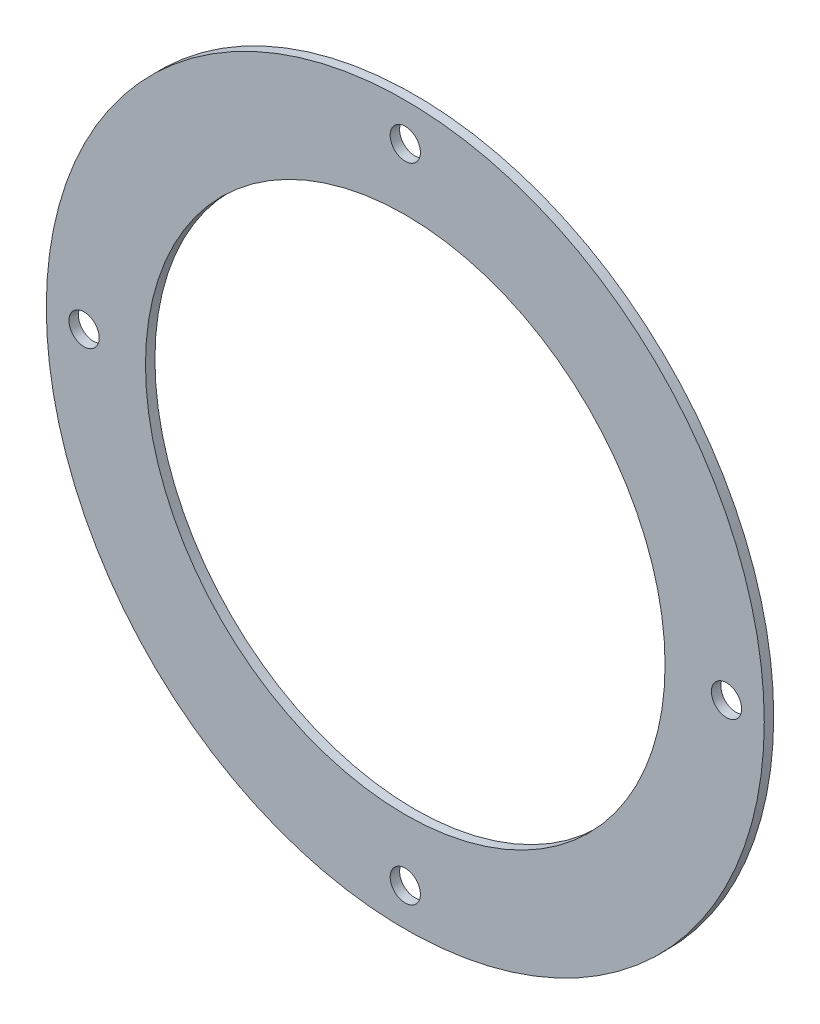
ISO-10303-21;
HEADER;
FILE_DESCRIPTION(('STEP AP214'),'2;1');
FILE_NAME('part.step','',(''),(''),'','','');
FILE_SCHEMA(('AUTOMOTIVE_DESIGN { 1 0 10303 214 1 1 1 1 }'));
ENDSEC;
DATA;
#1=APPLICATION_CONTEXT('core data for automotive mechanical design processes');
#2=APPLICATION_PROTOCOL_DEFINITION('international standard','automotive_design',2000,#1);
#3=PRODUCT_CONTEXT('',#1,'mechanical');
#4=PRODUCT('Part','Part','',(#3));
#5=PRODUCT_RELATED_PRODUCT_CATEGORY('part','',(#4));
#6=PRODUCT_DEFINITION_FORMATION('','',#4);
#7=PRODUCT_DEFINITION_CONTEXT('part definition',#1,'design');
#8=PRODUCT_DEFINITION('design','',#6,#7);
#9=PRODUCT_DEFINITION_SHAPE('','',#8);
#10=(LENGTH_UNIT() NAMED_UNIT(*) SI_UNIT(.MILLI.,.METRE.));
#11=(NAMED_UNIT(*) PLANE_ANGLE_UNIT() SI_UNIT($,.RADIAN.));
#12=(NAMED_UNIT(*) SI_UNIT($,.STERADIAN.) SOLID_ANGLE_UNIT());
#13=UNCERTAINTY_MEASURE_WITH_UNIT(LENGTH_MEASURE(1.E-05),#10,'distance_accuracy_value','');
#14=(GEOMETRIC_REPRESENTATION_CONTEXT(3) GLOBAL_UNCERTAINTY_ASSIGNED_CONTEXT((#13)) GLOBAL_UNIT_ASSIGNED_CONTEXT((#10,
#11,#12)) REPRESENTATION_CONTEXT('',''));
#15=CARTESIAN_POINT('',(0.,0.,0.));
#16=DIRECTION('',(0.,0.,1.));
#17=DIRECTION('',(1.,0.,0.));
#18=AXIS2_PLACEMENT_3D('',#15,#16,#17);
#19=CARTESIAN_POINT('',(0.,0.,0.));
#20=DIRECTION('',(0.,0.,1.));
#21=DIRECTION('',(1.,0.,0.));
#22=AXIS2_PLACEMENT_3D('',#19,#20,#21);
#23=PLANE('',#22);
#24=CARTESIAN_POINT('',(-34.,0.,0.));
#25=DIRECTION('',(0.,0.,1.));
#26=DIRECTION('',(1.,0.,0.));
#27=AXIS2_PLACEMENT_3D('',#24,#25,#26);
#28=CIRCLE('',#27,1.6);
#29=CARTESIAN_POINT('',(-32.4,0.,0.));
#30=VERTEX_POINT('',#29);
#31=EDGE_CURVE('E66',#30,#30,#28,.T.);
#32=ORIENTED_EDGE('',*,*,#31,.T.);
#33=EDGE_LOOP('',(#32));
#34=FACE_BOUND('',#33,.T.);
#35=CARTESIAN_POINT('',(0.,-34.,0.));
#36=DIRECTION('',(0.,0.,1.));
#37=DIRECTION('',(1.,0.,0.));
#38=AXIS2_PLACEMENT_3D('',#35,#36,#37);
#39=CIRCLE('',#38,1.6);
#40=CARTESIAN_POINT('',(1.6,-34.,0.));
#41=VERTEX_POINT('',#40);
#42=EDGE_CURVE('E61',#41,#41,#39,.T.);
#43=ORIENTED_EDGE('',*,*,#42,.T.);
#44=EDGE_LOOP('',(#43));
#45=FACE_BOUND('',#44,.T.);
#46=CARTESIAN_POINT('',(34.,0.,0.));
#47=DIRECTION('',(0.,0.,1.));
#48=DIRECTION('',(1.,0.,0.));
#49=AXIS2_PLACEMENT_3D('',#46,#47,#48);
#50=CIRCLE('',#49,1.6);
#51=CARTESIAN_POINT('',(35.6,0.,0.));
#52=VERTEX_POINT('',#51);
#53=EDGE_CURVE('E53',#52,#52,#50,.T.);
#54=ORIENTED_EDGE('',*,*,#53,.T.);
#55=EDGE_LOOP('',(#54));
#56=FACE_BOUND('',#55,.T.);
#57=CARTESIAN_POINT('',(0.,34.,0.));
#58=DIRECTION('',(0.,0.,1.));
#59=DIRECTION('',(1.,0.,0.));
#60=AXIS2_PLACEMENT_3D('',#57,#58,#59);
#61=CIRCLE('',#60,1.6);
#62=CARTESIAN_POINT('',(1.6,34.,0.));
#63=VERTEX_POINT('',#62);
#64=EDGE_CURVE('E45',#63,#63,#61,.T.);
#65=ORIENTED_EDGE('',*,*,#64,.T.);
#66=EDGE_LOOP('',(#65));
#67=FACE_BOUND('',#66,.T.);
#68=CARTESIAN_POINT('',(0.,0.,0.));
#69=DIRECTION('',(0.,0.,1.));
#70=DIRECTION('',(1.,0.,0.));
#71=AXIS2_PLACEMENT_3D('',#68,#69,#70);
#72=CIRCLE('',#71,27.5);
#73=CARTESIAN_POINT('',(27.5,0.,0.));
#74=VERTEX_POINT('',#73);
#75=EDGE_CURVE('E32',#74,#74,#72,.T.);
#76=ORIENTED_EDGE('',*,*,#75,.T.);
#77=EDGE_LOOP('',(#76));
#78=FACE_BOUND('',#77,.T.);
#79=CARTESIAN_POINT('',(0.,0.,0.));
#80=DIRECTION('',(0.,0.,1.));
#81=DIRECTION('',(1.,0.,0.));
#82=AXIS2_PLACEMENT_3D('',#79,#80,#81);
#83=CIRCLE('',#82,38.);
#84=CARTESIAN_POINT('',(38.,0.,0.));
#85=VERTEX_POINT('',#84);
#86=EDGE_CURVE('E10',#85,#85,#83,.T.);
#87=ORIENTED_EDGE('',*,*,#86,.F.);
#88=EDGE_LOOP('',(#87));
#89=FACE_BOUND('',#88,.T.);
#90=ADVANCED_FACE('F15',(#34,#45,#56,#67,#78,#89),#23,.F.);
#91=CARTESIAN_POINT('',(0.,0.,1.));
#92=DIRECTION('',(0.,0.,1.));
#93=DIRECTION('',(1.,0.,0.));
#94=AXIS2_PLACEMENT_3D('',#91,#92,#93);
#95=PLANE('',#94);
#96=CARTESIAN_POINT('',(-34.,0.,1.));
#97=DIRECTION('',(0.,0.,1.));
#98=DIRECTION('',(1.,0.,0.));
#99=AXIS2_PLACEMENT_3D('',#96,#97,#98);
#100=CIRCLE('',#99,1.6);
#101=CARTESIAN_POINT('',(-32.4,0.,1.));
#102=VERTEX_POINT('',#101);
#103=EDGE_CURVE('E70',#102,#102,#100,.T.);
#104=ORIENTED_EDGE('',*,*,#103,.F.);
#105=EDGE_LOOP('',(#104));
#106=FACE_BOUND('',#105,.T.);
#107=CARTESIAN_POINT('',(34.,0.,1.));
#108=DIRECTION('',(0.,0.,1.));
#109=DIRECTION('',(1.,0.,0.));
#110=AXIS2_PLACEMENT_3D('',#107,#108,#109);
#111=CIRCLE('',#110,1.6);
#112=CARTESIAN_POINT('',(35.6,0.,1.));
#113=VERTEX_POINT('',#112);
#114=EDGE_CURVE('E57',#113,#113,#111,.T.);
#115=ORIENTED_EDGE('',*,*,#114,.F.);
#116=EDGE_LOOP('',(#115));
#117=FACE_BOUND('',#116,.T.);
#118=CARTESIAN_POINT('',(0.,0.,1.));
#119=DIRECTION('',(0.,0.,1.));
#120=DIRECTION('',(1.,0.,0.));
#121=AXIS2_PLACEMENT_3D('',#118,#119,#120);
#122=CIRCLE('',#121,27.5);
#123=CARTESIAN_POINT('',(27.5,0.,1.));
#124=VERTEX_POINT('',#123);
#125=EDGE_CURVE('E39',#124,#124,#122,.T.);
#126=ORIENTED_EDGE('',*,*,#125,.F.);
#127=EDGE_LOOP('',(#126));
#128=FACE_BOUND('',#127,.T.);
#129=CARTESIAN_POINT('',(0.,34.,1.));
#130=DIRECTION('',(0.,0.,1.));
#131=DIRECTION('',(1.,0.,0.));
#132=AXIS2_PLACEMENT_3D('',#129,#130,#131);
#133=CIRCLE('',#132,1.6);
#134=CARTESIAN_POINT('',(1.6,34.,1.));
#135=VERTEX_POINT('',#134);
#136=EDGE_CURVE('E49',#135,#135,#133,.T.);
#137=ORIENTED_EDGE('',*,*,#136,.F.);
#138=EDGE_LOOP('',(#137));
#139=FACE_BOUND('',#138,.T.);
#140=CARTESIAN_POINT('',(0.,-34.,1.));
#141=DIRECTION('',(0.,0.,1.));
#142=DIRECTION('',(1.,0.,0.));
#143=AXIS2_PLACEMENT_3D('',#140,#141,#142);
#144=CIRCLE('',#143,1.6);
#145=CARTESIAN_POINT('',(1.6,-34.,1.));
#146=VERTEX_POINT('',#145);
#147=EDGE_CURVE('E65',#146,#146,#144,.T.);
#148=ORIENTED_EDGE('',*,*,#147,.F.);
#149=EDGE_LOOP('',(#148));
#150=FACE_BOUND('',#149,.T.);
#151=CARTESIAN_POINT('',(0.,0.,1.));
#152=DIRECTION('',(0.,0.,1.));
#153=DIRECTION('',(1.,0.,0.));
#154=AXIS2_PLACEMENT_3D('',#151,#152,#153);
#155=CIRCLE('',#154,38.);
#156=CARTESIAN_POINT('',(38.,0.,1.));
#157=VERTEX_POINT('',#156);
#158=EDGE_CURVE('E23',#157,#157,#155,.T.);
#159=ORIENTED_EDGE('',*,*,#158,.T.);
#160=EDGE_LOOP('',(#159));
#161=FACE_BOUND('',#160,.T.);
#162=ADVANCED_FACE('F17',(#106,#117,#128,#139,#150,#161),#95,.T.);
#163=CARTESIAN_POINT('',(0.,0.,1.));
#164=DIRECTION('',(0.,0.,-1.));
#165=DIRECTION('',(-1.,0.,0.));
#166=AXIS2_PLACEMENT_3D('',#163,#164,#165);
#167=CYLINDRICAL_SURFACE('',#166,38.);
#168=ORIENTED_EDGE('',*,*,#86,.T.);
#169=EDGE_LOOP('',(#168));
#170=FACE_BOUND('',#169,.T.);
#171=ORIENTED_EDGE('',*,*,#158,.F.);
#172=EDGE_LOOP('',(#171));
#173=FACE_BOUND('',#172,.T.);
#174=ADVANCED_FACE('F84',(#170,#173),#167,.T.);
#175=CARTESIAN_POINT('',(0.,0.,1.));
#176=DIRECTION('',(0.,0.,-1.));
#177=DIRECTION('',(-1.,0.,0.));
#178=AXIS2_PLACEMENT_3D('',#175,#176,#177);
#179=CYLINDRICAL_SURFACE('',#178,27.5);
#180=ORIENTED_EDGE('',*,*,#75,.F.);
#181=EDGE_LOOP('',(#180));
#182=FACE_BOUND('',#181,.T.);
#183=ORIENTED_EDGE('',*,*,#125,.T.);
#184=EDGE_LOOP('',(#183));
#185=FACE_BOUND('',#184,.T.);
#186=ADVANCED_FACE('F118',(#182,#185),#179,.F.);
#187=CARTESIAN_POINT('',(0.,34.,1.));
#188=DIRECTION('',(0.,0.,-1.));
#189=DIRECTION('',(-1.,0.,0.));
#190=AXIS2_PLACEMENT_3D('',#187,#188,#189);
#191=CYLINDRICAL_SURFACE('',#190,1.6);
#192=ORIENTED_EDGE('',*,*,#64,.F.);
#193=EDGE_LOOP('',(#192));
#194=FACE_BOUND('',#193,.T.);
#195=ORIENTED_EDGE('',*,*,#136,.T.);
#196=EDGE_LOOP('',(#195));
#197=FACE_BOUND('',#196,.T.);
#198=ADVANCED_FACE('F105',(#194,#197),#191,.F.);
#199=CARTESIAN_POINT('',(34.,0.,1.));
#200=DIRECTION('',(0.,0.,-1.));
#201=DIRECTION('',(-1.,0.,0.));
#202=AXIS2_PLACEMENT_3D('',#199,#200,#201);
#203=CYLINDRICAL_SURFACE('',#202,1.6);
#204=ORIENTED_EDGE('',*,*,#53,.F.);
#205=EDGE_LOOP('',(#204));
#206=FACE_BOUND('',#205,.T.);
#207=ORIENTED_EDGE('',*,*,#114,.T.);
#208=EDGE_LOOP('',(#207));
#209=FACE_BOUND('',#208,.T.);
#210=ADVANCED_FACE('F95',(#206,#209),#203,.F.);
#211=CARTESIAN_POINT('',(0.,-34.,1.));
#212=DIRECTION('',(0.,0.,-1.));
#213=DIRECTION('',(-1.,0.,0.));
#214=AXIS2_PLACEMENT_3D('',#211,#212,#213);
#215=CYLINDRICAL_SURFACE('',#214,1.6);
#216=ORIENTED_EDGE('',*,*,#42,.F.);
#217=EDGE_LOOP('',(#216));
#218=FACE_BOUND('',#217,.T.);
#219=ORIENTED_EDGE('',*,*,#147,.T.);
#220=EDGE_LOOP('',(#219));
#221=FACE_BOUND('',#220,.T.);
#222=ADVANCED_FACE('F93',(#218,#221),#215,.F.);
#223=CARTESIAN_POINT('',(-34.,0.,1.));
#224=DIRECTION('',(0.,0.,-1.));
#225=DIRECTION('',(-1.,0.,0.));
#226=AXIS2_PLACEMENT_3D('',#223,#224,#225);
#227=CYLINDRICAL_SURFACE('',#226,1.6);
#228=ORIENTED_EDGE('',*,*,#31,.F.);
#229=EDGE_LOOP('',(#228));
#230=FACE_BOUND('',#229,.T.);
#231=ORIENTED_EDGE('',*,*,#103,.T.);
#232=EDGE_LOOP('',(#231));
#233=FACE_BOUND('',#232,.T.);
#234=ADVANCED_FACE('F80',(#230,#233),#227,.F.);
#235=CLOSED_SHELL('',(#90,#162,#174,#186,#198,#210,#222,#234));
#236=MANIFOLD_SOLID_BREP('B1',#235);
#237=ADVANCED_BREP_SHAPE_REPRESENTATION('',(#18,#236),#14);
#238=SHAPE_DEFINITION_REPRESENTATION(#9,#237);
ENDSEC;
END-ISO-10303-21;
